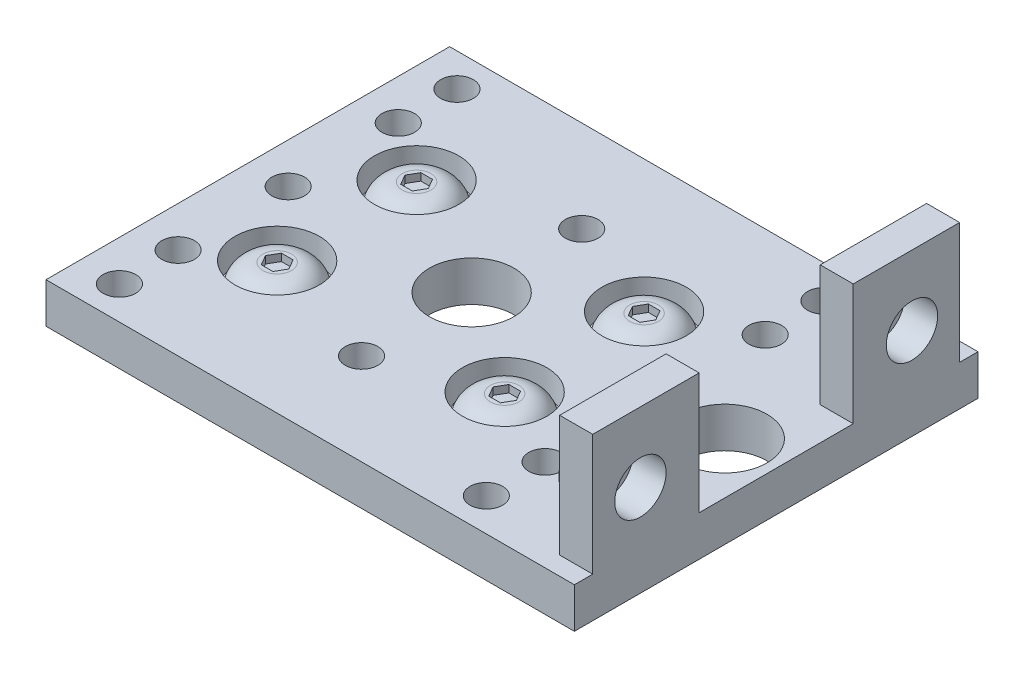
from build123d import *

# Parameters (mm, degrees)
SKETCH1_W                 = 36.576
SKETCH1_H                 = 27.94
BASE_DEPTH                = 2.794
SKETCH2_W                 = 2.286
SKETCH2_H                 = 7.366
TABS_DEPTH                = 11.176
SKETCH3_R                 = 1.778
TAB_HOLES_DEPTH           = 41.716920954
F_4_40_TAPPED_HOLE1_D     = 2.2606
F_4_40_TAPPED_HOLE1_DEPTH = 7.62
F_4_40_TAPPED_HOLE1_TIP   = 0.679152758
SKETCH7_R                 = 2.921
COUNTER_DEPTH             = 1.778
SKETCH8_R                 = 1.524
THRU_DEPTH                = 26.156260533
SKETCH9_R                 = 2.921
THRU_2_DEPTH              = 25.492238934
SCREW_HEX_DEPTH           = 0.508
LPATTERN1_COUNT           = 2
LPATTERN1_PITCH           = 15.748
LPATTERN1_COUNT_DIR2      = 2
LPATTERN1_PITCH_DIR2      = 9.652
VERT_SCREW_HEX_DEPTH      = 0.508
LPATTERN2_COUNT           = 2
LPATTERN2_PITCH           = 18.796


with BuildPart() as part:
    # Sketch1 → Base (new body)
    with BuildSketch(Plane(origin=(0, 0, 0), x_dir=(1, 0, 0), z_dir=(0, 1, 0))):
        Rectangle(SKETCH1_W, SKETCH1_H)
    extrude(amount=BASE_DEPTH)

    # Sketch2 → Tabs (add)
    with BuildSketch(Plane(origin=(0, 0, 0), x_dir=(1, 0, 0), z_dir=(0, 1, 0))):
        with Locations((17.145, 9.017)):
            Rectangle(SKETCH2_W, SKETCH2_H)
        with Locations((17.145, -9.017)):
            Rectangle(SKETCH2_W, SKETCH2_H)
    extrude(amount=TABS_DEPTH)

    # Sketch3 → Tab Holes (cut, through all)
    with BuildSketch(Plane(origin=(18.288, 0, 0), x_dir=(0, 0, -1), z_dir=(1, 0, 0))):
        with Locations((-9.398, 6.35)):
            Circle(SKETCH3_R)
        with Locations((9.398, 6.35)):
            Circle(SKETCH3_R)
    extrude(amount=-TAB_HOLES_DEPTH, mode=Mode.SUBTRACT)

    # 4-40 Tapped Hole1
    with Locations(Plane(origin=(0, 2.794, 0), x_dir=(-1, 0, 0), z_dir=(0, 1, 0))):
        with Locations((15.494, -11.684), (15.494, -7.62), (15.494, 0), (15.494, 7.62), (15.494, 11.684), (-9.906, 11.684), (-9.906, 7.62), (-9.906, 0), (-9.906, -7.62), (-9.906, -11.684), (2.794, -7.62), (2.794, 7.62)):
            Hole(F_4_40_TAPPED_HOLE1_D / 2, depth=F_4_40_TAPPED_HOLE1_DEPTH)
            with Locations((0, 0, -(F_4_40_TAPPED_HOLE1_DEPTH + F_4_40_TAPPED_HOLE1_TIP / 2))):  # 118° drill point
                Cone(0, F_4_40_TAPPED_HOLE1_D / 2, F_4_40_TAPPED_HOLE1_TIP, mode=Mode.SUBTRACT)

    # Sketch7 → Counter (cut)
    with BuildSketch(Plane(origin=(0, 2.794, 0), x_dir=(1, 0, 0), z_dir=(0, 1, 0))):
        with Locations(Location((-11.43, 4.826, 0), (0, 0, 270))):
            Circle(SKETCH7_R)
        with Locations(Location((4.318, 4.826, 0), (0, 0, 270))):
            Circle(SKETCH7_R)
        with Locations(Location((4.318, -4.826, 0), (0, 0, 270))):
            Circle(SKETCH7_R)
        with Locations(Location((-11.43, -4.826, 0), (0, 0, 270))):
            Circle(SKETCH7_R)
    extrude(amount=-COUNTER_DEPTH, mode=Mode.SUBTRACT)

    # Sketch8 → Thru (cut, through all)
    with BuildSketch(Plane(origin=(0, 1.016, 0), x_dir=(1, 0, 0), z_dir=(0, 1, 0))):
        with Locations(Location((-11.43, 4.826, 0), (0, 0, 270))):
            Circle(SKETCH8_R)
        with Locations(Location((4.318, 4.826, 0), (0, 0, 270))):
            Circle(SKETCH8_R)
        with Locations(Location((4.318, -4.826, 0), (0, 0, 270))):
            Circle(SKETCH8_R)
        with Locations(Location((-11.43, -4.826, 0), (0, 0, 270))):
            Circle(SKETCH8_R)
    extrude(amount=-THRU_DEPTH, mode=Mode.SUBTRACT)

    # Sketch9 → Thru 2 (cut, through all)
    with BuildSketch(Plane(origin=(0, 2.794, 0), x_dir=(1, 0, 0), z_dir=(0, 1, 0))):
        with Locations(Location((14.732, 0, 0), (0, 0, 270))):
            Circle(SKETCH9_R)
        with Locations(Location((-2.794, 0, 0), (0, 0, 270))):
            Circle(SKETCH9_R)
    extrude(amount=-THRU_2_DEPTH, mode=Mode.SUBTRACT)

    # Sketch11 → Screw (revolve)
    with BuildSketch(Plane.XY.offset(4.826), mode=Mode.PRIVATE) as screw_sk:
        with BuildLine():
            Line((-11.43, 1.016), (-8.763, 1.016))
            ThreePointArc((-8.763, 1.016), (-9.254006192, 2.201393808), (-10.4394, 2.6924))
            Line((-10.4394, 2.6924), (-11.43, 2.6924))
            Line((-11.43, 2.6924), (-11.43, 1.016))
        make_face()
    screw = revolve(screw_sk.sketch.rotate(Axis((-11.43, 2.6924, 4.826), (0, 1, 0)), 90), axis=Axis((-11.43, 2.6924, 4.826), (0, 1, 0)))

    # Sketch12 → Screw Hex (cut)
    with BuildSketch(Plane(origin=(0, 2.6924, 0), x_dir=(1, 0, 0), z_dir=(0, 1, 0))):
        Polygon((-11.026720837, -4.1275), (-11.833279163, -4.1275), (-12.236558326, -4.826), (-11.833279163, -5.5245), (-11.026720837, -5.5245), (-10.623441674, -4.826), align=None)
    screw_hex = extrude(amount=-SCREW_HEX_DEPTH, mode=Mode.SUBTRACT)

    # LPattern1: Screw, Screw Hex 2 × 2
    with Locations(*[(i * LPATTERN1_PITCH, 0, -j * LPATTERN1_PITCH_DIR2) for i in range(LPATTERN1_COUNT) for j in range(LPATTERN1_COUNT_DIR2) if (i, j) != (0, 0)]):
        add(screw)
        add(screw_hex, mode=Mode.SUBTRACT)

    # Sketch13 → Vert Screw (revolve)
    with BuildSketch(Plane.XY.offset(9.398), mode=Mode.PRIVATE) as vert_screw_sk:
        with BuildLine():
            Line((16.002, 6.35), (16.002, 3.683))
            ThreePointArc((16.002, 3.683), (14.816606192, 4.174006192), (14.3256, 5.3594))
            Line((14.3256, 5.3594), (14.3256, 6.35))
            Line((14.3256, 6.35), (16.002, 6.35))
        make_face()
    vert_screw = revolve(vert_screw_sk.sketch.rotate(Axis((17.145, 6.35, 9.398), (-1, 0, 0)), 270), axis=Axis((17.145, 6.35, 9.398), (-1, 0, 0)))

    # Sketch14 → Vert Screw Hex (cut)
    with BuildSketch(Plane.ZY.offset(-14.3256)):
        Polygon((9.398, 7.156558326), (8.6995, 6.753279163), (8.6995, 5.946720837), (9.398, 5.543441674), (10.0965, 5.946720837), (10.0965, 6.753279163), align=None)
    vert_screw_hex = extrude(amount=-VERT_SCREW_HEX_DEPTH, mode=Mode.SUBTRACT)

    # LPattern2: Vert Screw, Vert Screw Hex ×2
    with Locations(*[(0, 0, -i * LPATTERN2_PITCH) for i in range(1, LPATTERN2_COUNT)]):
        add(vert_screw)
        add(vert_screw_hex, mode=Mode.SUBTRACT)


solid = part.part
